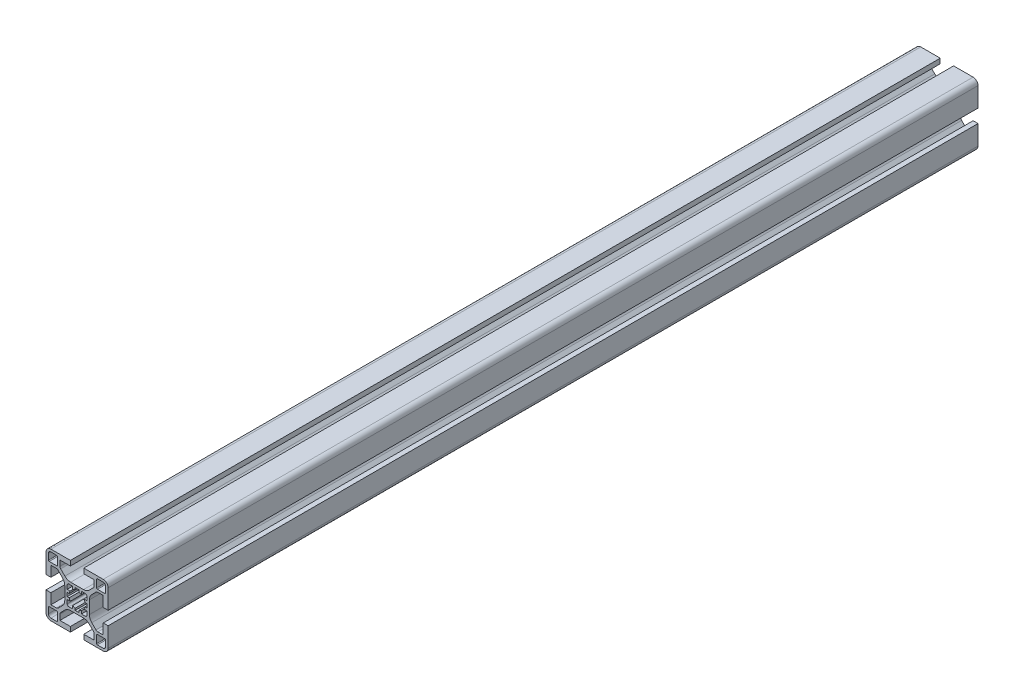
from build123d import *

# Parameters (mm, degrees)
SKETCH1_R           = 5
BOSS_EXTRUDE1_DEPTH = 533.4
CUT_EXTRUDE1_DEPTH  = 6000
CUT_EXTRUDE2_DEPTH  = 6000
CUT_EXTRUDE3_DEPTH  = 6000
CUT_EXTRUDE4_DEPTH  = 6000
CUT_EXTRUDE5_DEPTH  = 6000


with BuildPart() as part:
    # Sketch1 → Boss-Extrude1 (new body)
    with BuildSketch(Plane.XY):
        with BuildLine():
            Line((-19.05, -4.1), (-19.05, -16.05))
            ThreePointArc((-19.05, -16.05), (-18.171320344, -18.171320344), (-16.05, -19.05))
            Line((-16.05, -19.05), (-4.1, -19.05))
            Line((-4.1, -19.05), (-4.1, -16.05))
            Line((-4.1, -16.05), (-10.5, -16.05))
            Line((-10.5, -16.05), (-10.5, -12.7127))
            ThreePointArc((-10.5, -12.7127), (-10.378208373, -12.100409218), (-10.03135, -11.58135))
            Line((-10.03135, -11.58135), (-7.464465, -9.014465))
            ThreePointArc((-7.464465, -9.014465), (-5.842347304, -7.930602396), (-3.92893, -7.55))
            Line((-3.92893, -7.55), (3.92893, -7.55))
            ThreePointArc((3.92893, -7.55), (5.842347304, -7.930602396), (7.464465, -9.014465))
            Line((7.464465, -9.014465), (10.03135, -11.58135))
            ThreePointArc((10.03135, -11.58135), (10.378208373, -12.100409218), (10.5, -12.7127))
            Line((10.5, -12.7127), (10.5, -16.05))
            Line((10.5, -16.05), (4.1, -16.05))
            Line((4.1, -16.05), (4.1, -19.05))
            Line((4.1, -19.05), (16.05, -19.05))
            ThreePointArc((16.05, -19.05), (18.171320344, -18.171320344), (19.05, -16.05))
            Line((19.05, -16.05), (19.05, -4.1))
            Line((19.05, -4.1), (16.05, -4.1))
            Line((16.05, -4.1), (16.05, -10.5))
            Line((16.05, -10.5), (12.7127, -10.5))
            ThreePointArc((12.7127, -10.5), (12.100409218, -10.378208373), (11.58135, -10.03135))
            Line((11.58135, -10.03135), (9.014465, -7.464465))
            ThreePointArc((9.014465, -7.464465), (7.930602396, -5.842347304), (7.55, -3.92893))
            Line((7.55, -3.92893), (7.55, 3.92893))
            ThreePointArc((7.55, 3.92893), (7.930602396, 5.842347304), (9.014465, 7.464465))
            Line((9.014465, 7.464465), (11.58135, 10.03135))
            ThreePointArc((11.58135, 10.03135), (12.100409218, 10.378208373), (12.7127, 10.5))
            Line((12.7127, 10.5), (16.05, 10.5))
            Line((16.05, 10.5), (16.05, 4.1))
            Line((16.05, 4.1), (19.05, 4.1))
            Line((19.05, 4.1), (19.05, 16.05))
            ThreePointArc((19.05, 16.05), (18.171320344, 18.171320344), (16.05, 19.05))
            Line((16.05, 19.05), (4.1, 19.05))
            Line((4.1, 19.05), (4.1, 16.05))
            Line((4.1, 16.05), (10.5, 16.05))
            Line((10.5, 16.05), (10.5, 12.7127))
            ThreePointArc((10.5, 12.7127), (10.378208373, 12.100409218), (10.03135, 11.58135))
            Line((10.03135, 11.58135), (7.464465, 9.014465))
            ThreePointArc((7.464465, 9.014465), (5.842347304, 7.930602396), (3.92893, 7.55))
            Line((3.92893, 7.55), (-3.92893, 7.55))
            ThreePointArc((-3.92893, 7.55), (-5.842347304, 7.930602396), (-7.464465, 9.014465))
            Line((-7.464465, 9.014465), (-10.03135, 11.58135))
            ThreePointArc((-10.03135, 11.58135), (-10.378208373, 12.100409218), (-10.5, 12.7127))
            Line((-10.5, 12.7127), (-10.5, 16.05))
            Line((-10.5, 16.05), (-4.1, 16.05))
            Line((-4.1, 16.05), (-4.1, 19.05))
            Line((-4.1, 19.05), (-16.05, 19.05))
            ThreePointArc((-16.05, 19.05), (-18.171320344, 18.171320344), (-19.05, 16.05))
            Line((-19.05, 16.05), (-19.05, 4.1))
            Line((-19.05, 4.1), (-16.05, 4.1))
            Line((-16.05, 4.1), (-16.05, 10.5))
            Line((-16.05, 10.5), (-12.7127, 10.5))
            ThreePointArc((-12.7127, 10.5), (-12.100409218, 10.378208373), (-11.58135, 10.03135))
            Line((-11.58135, 10.03135), (-9.014465, 7.464465))
            ThreePointArc((-9.014465, 7.464465), (-7.930602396, 5.842347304), (-7.55, 3.92893))
            Line((-7.55, 3.92893), (-7.55, -3.92893))
            ThreePointArc((-7.55, -3.92893), (-7.930602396, -5.842347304), (-9.014465, -7.464465))
            Line((-9.014465, -7.464465), (-11.58135, -10.03135))
            ThreePointArc((-11.58135, -10.03135), (-12.100409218, -10.378208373), (-12.7127, -10.5))
            Line((-12.7127, -10.5), (-16.05, -10.5))
            Line((-16.05, -10.5), (-16.05, -4.1))
            Line((-16.05, -4.1), (-19.05, -4.1))
        make_face()
        Circle(SKETCH1_R, mode=Mode.SUBTRACT)
    extrude(amount=-BOSS_EXTRUDE1_DEPTH)

    # Sketch2 → Cut-Extrude1 (cut)
    with BuildSketch(Plane.XY):
        with BuildLine():
            Line((-17.55, -12.5), (-17.55, -16.05))
            ThreePointArc((-17.55, -16.05), (-17.110660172, -17.110660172), (-16.05, -17.55))
            Line((-16.05, -17.55), (-12.5, -17.55))
            ThreePointArc((-12.5, -17.55), (-12.146446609, -17.403553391), (-12, -17.05))
            Line((-12, -17.05), (-12, -12.5))
            ThreePointArc((-12, -12.5), (-12.146446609, -12.146446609), (-12.5, -12))
            Line((-12.5, -12), (-17.05, -12))
            ThreePointArc((-17.05, -12), (-17.403553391, -12.146446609), (-17.55, -12.5))
        make_face()
    extrude(amount=-CUT_EXTRUDE1_DEPTH, mode=Mode.SUBTRACT)

    # Sketch3 → Cut-Extrude2 (cut)
    with BuildSketch(Plane.XY):
        with BuildLine():
            Line((12.5, -17.55), (16.05, -17.55))
            ThreePointArc((16.05, -17.55), (17.110660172, -17.110660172), (17.55, -16.05))
            Line((17.55, -16.05), (17.55, -12.5))
            ThreePointArc((17.55, -12.5), (17.403553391, -12.146446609), (17.05, -12))
            Line((17.05, -12), (12.5, -12))
            ThreePointArc((12.5, -12), (12.146446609, -12.146446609), (12, -12.5))
            Line((12, -12.5), (12, -17.05))
            ThreePointArc((12, -17.05), (12.146446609, -17.403553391), (12.5, -17.55))
        make_face()
    extrude(amount=-CUT_EXTRUDE2_DEPTH, mode=Mode.SUBTRACT)

    # Sketch4 → Cut-Extrude3 (cut)
    with BuildSketch(Plane.XY):
        with BuildLine():
            Line((-6.05, 1.06724), (-6.05, -1.19102))
            Line((-6.05, -1.19102), (-4.85654377, -1.189110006))
            ThreePointArc((-4.85654377, -1.189110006), (-4.594960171, -1.971380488), (-4.208325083, -2.7))
            Line((-4.208325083, -2.7), (-6.05, -2.7))
            Line((-6.05, -2.7), (-6.05, -5.05))
            ThreePointArc((-6.05, -5.05), (-5.757106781, -5.757106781), (-5.05, -6.05))
            Line((-5.05, -6.05), (-2.7, -6.05))
            Line((-2.7, -6.05), (-2.7, -4.208325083))
            ThreePointArc((-2.7, -4.208325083), (-1.952880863, -4.602853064), (-1.15, -4.865953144))
            Line((-1.15, -4.865953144), (-1.15, -6.05))
            Line((-1.15, -6.05), (1.15, -6.05))
            Line((1.15, -6.05), (1.15, -4.865953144))
            ThreePointArc((1.15, -4.865953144), (1.952880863, -4.602853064), (2.7, -4.208325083))
            Line((2.7, -4.208325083), (2.7, -6.05))
            Line((2.7, -6.05), (5.05, -6.05))
            ThreePointArc((5.05, -6.05), (5.757106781, -5.757106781), (6.05, -5.05))
            Line((6.05, -5.05), (6.05, -2.7))
            Line((6.05, -2.7), (4.208325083, -2.7))
            ThreePointArc((4.208325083, -2.7), (4.598107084, -1.964029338), (4.860322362, -1.173569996))
            Line((4.860322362, -1.173569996), (6.05, -1.17167))
            Line((6.05, -1.17167), (6.05, 1.10628))
            Line((6.05, 1.10628), (4.876934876, 1.102499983))
            ThreePointArc((4.876934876, 1.102499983), (4.612319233, 1.930417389), (4.208325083, 2.7))
            Line((4.208325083, 2.7), (6.05, 2.7))
            Line((6.05, 2.7), (6.05, 5.05))
            ThreePointArc((6.05, 5.05), (5.757106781, 5.757106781), (5.05, 6.05))
            Line((5.05, 6.05), (2.7, 6.05))
            Line((2.7, 6.05), (2.7, 4.208325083))
            ThreePointArc((2.7, 4.208325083), (1.952880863, 4.602853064), (1.15, 4.865953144))
            Line((1.15, 4.865953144), (1.15, 6.05))
            Line((1.15, 6.05), (-1.15, 6.05))
            Line((-1.15, 6.05), (-1.15, 4.865953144))
            ThreePointArc((-1.15, 4.865953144), (-1.952880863, 4.602853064), (-2.7, 4.208325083))
            Line((-2.7, 4.208325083), (-2.7, 6.05))
            Line((-2.7, 6.05), (-5.05, 6.05))
            ThreePointArc((-5.05, 6.05), (-5.757106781, 5.757106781), (-6.05, 5.05))
            Line((-6.05, 5.05), (-6.05, 2.7))
            Line((-6.05, 2.7), (-4.208325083, 2.7))
            ThreePointArc((-4.208325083, 2.7), (-4.618524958, 1.9155227), (-4.883949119, 1.071000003))
            Line((-4.883949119, 1.071000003), (-6.05, 1.06724))
        make_face()
    extrude(amount=-CUT_EXTRUDE3_DEPTH, mode=Mode.SUBTRACT)

    # Sketch5 → Cut-Extrude4 (cut)
    with BuildSketch(Plane.XY):
        with BuildLine():
            Line((12, 17.05), (12, 12.5))
            ThreePointArc((12, 12.5), (12.146446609, 12.146446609), (12.5, 12))
            Line((12.5, 12), (17.05, 12))
            ThreePointArc((17.05, 12), (17.403553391, 12.146446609), (17.55, 12.5))
            Line((17.55, 12.5), (17.55, 16.05))
            ThreePointArc((17.55, 16.05), (17.110660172, 17.110660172), (16.05, 17.55))
            Line((16.05, 17.55), (12.5, 17.55))
            ThreePointArc((12.5, 17.55), (12.146446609, 17.403553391), (12, 17.05))
        make_face()
    extrude(amount=-CUT_EXTRUDE4_DEPTH, mode=Mode.SUBTRACT)

    # Sketch6 → Cut-Extrude5 (cut)
    with BuildSketch(Plane.XY):
        with BuildLine():
            Line((-17.05, 12), (-12.5, 12))
            ThreePointArc((-12.5, 12), (-12.146446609, 12.146446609), (-12, 12.5))
            Line((-12, 12.5), (-12, 17.05))
            ThreePointArc((-12, 17.05), (-12.146446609, 17.403553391), (-12.5, 17.55))
            Line((-12.5, 17.55), (-16.05, 17.55))
            ThreePointArc((-16.05, 17.55), (-17.110660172, 17.110660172), (-17.55, 16.05))
            Line((-17.55, 16.05), (-17.55, 12.5))
            ThreePointArc((-17.55, 12.5), (-17.403553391, 12.146446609), (-17.05, 12))
        make_face()
    extrude(amount=-CUT_EXTRUDE5_DEPTH, mode=Mode.SUBTRACT)

    # Sketch7 → Hole Wizard 3465 (revolve, cut)
    with BuildSketch(Plane(origin=(-20.05, 0, -33), x_dir=(0, 0, 1), z_dir=(0, 1, 0))):
        Polygon((0, 0), (0, 25), (5.75, 25), (5.75, 24.850000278), (6.6, 24), (6.6, 0), align=None)
    revolve(axis=Axis((-26.180023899, 0, -33), (1, 0, 0)), mode=Mode.SUBTRACT)

    # Sketch9 → Hole2 (revolve, cut)
    with BuildSketch(Plane(origin=(-20.05, 0, -500.4), x_dir=(0, 0, 1), z_dir=(0, 1, 0))):
        Polygon((0, 0), (0, 25), (5.75, 25), (5.75, 24.850000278), (6.6, 24), (6.6, 0), align=None)
    revolve(axis=Axis((-26.180023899, 0, -500.4), (1, 0, 0)), mode=Mode.SUBTRACT)


solid = part.part
